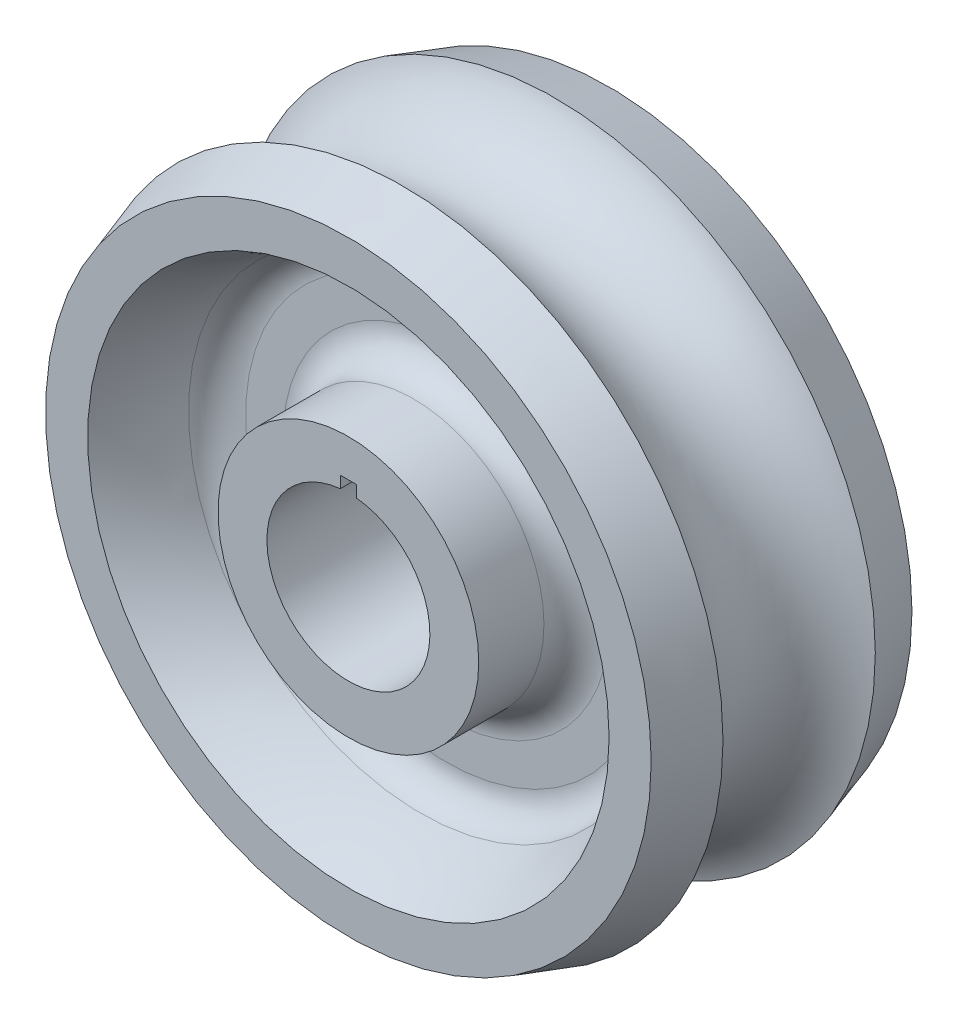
from build123d import *

# Parameters (mm, degrees)
CUT_EXTRUDE1_DEPTH = 51.928528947


with BuildPart() as part:
    # Sketch1 → Base-Revolve (revolve)
    with BuildSketch(Plane(origin=(0, 0, 0), x_dir=(0, 0, -1), z_dir=(1, 0, 0)), mode=Mode.PRIVATE) as base_revolve_sk:
        with BuildLine():
            Line((-12.7, 7.9375), (12.7, 7.9375))
            Line((12.7, 7.9375), (12.7, 12.7))
            Line((12.7, 12.7), (6.35, 12.7))
            ThreePointArc((6.35, 12.7), (4.10493597, 13.62993597), (3.175, 15.875))
            Line((3.175, 15.875), (3.175, 19.536533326))
            ThreePointArc((3.175, 19.536533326), (3.867988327, 21.516493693), (5.644444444, 22.632145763))
            ThreePointArc((5.644444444, 22.632145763), (9.276039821, 23.751430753), (12.7, 25.4))
            Line((12.7, 25.4), (12.7, 29.5021))
            Line((12.7, 29.5021), (7.418151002, 31.213419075))
            ThreePointArc((7.418151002, 31.213419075), (0, 25.8191), (-7.418151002, 31.213419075))
            Line((-7.418151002, 31.213419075), (-12.7, 29.5021))
            Line((-12.7, 29.5021), (-12.7, 25.4))
            ThreePointArc((-12.7, 25.4), (-9.276039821, 23.751430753), (-5.644444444, 22.632145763))
            ThreePointArc((-5.644444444, 22.632145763), (-3.867988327, 21.516493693), (-3.175, 19.536533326))
            Line((-3.175, 19.536533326), (-3.175, 15.875))
            ThreePointArc((-3.175, 15.875), (-4.10493597, 13.62993597), (-6.35, 12.7))
            Line((-6.35, 12.7), (-12.7, 12.7))
            Line((-12.7, 12.7), (-12.7, 7.9375))
        make_face()
    revolve(base_revolve_sk.sketch.rotate(Axis((0, 0, 0), (0, 0, -1)), 90), axis=Axis((0, 0, 0), (0, 0, -1)))

    # Sketch2 → Cut-Extrude1 (cut, through all)
    with BuildSketch(Plane.XY.offset(12.7)):
        with BuildLine():
            Line((-0.79375, 7.897712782), (-0.79375, 9.0424))
            Line((-0.79375, 9.0424), (0.79375, 9.0424))
            Line((0.79375, 9.0424), (0.79375, 7.897712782))
            ThreePointArc((0.79375, 7.897712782), (0, 7.9375), (-0.79375, 7.897712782))
        make_face()
    extrude(amount=-CUT_EXTRUDE1_DEPTH, mode=Mode.SUBTRACT)


solid = part.part
